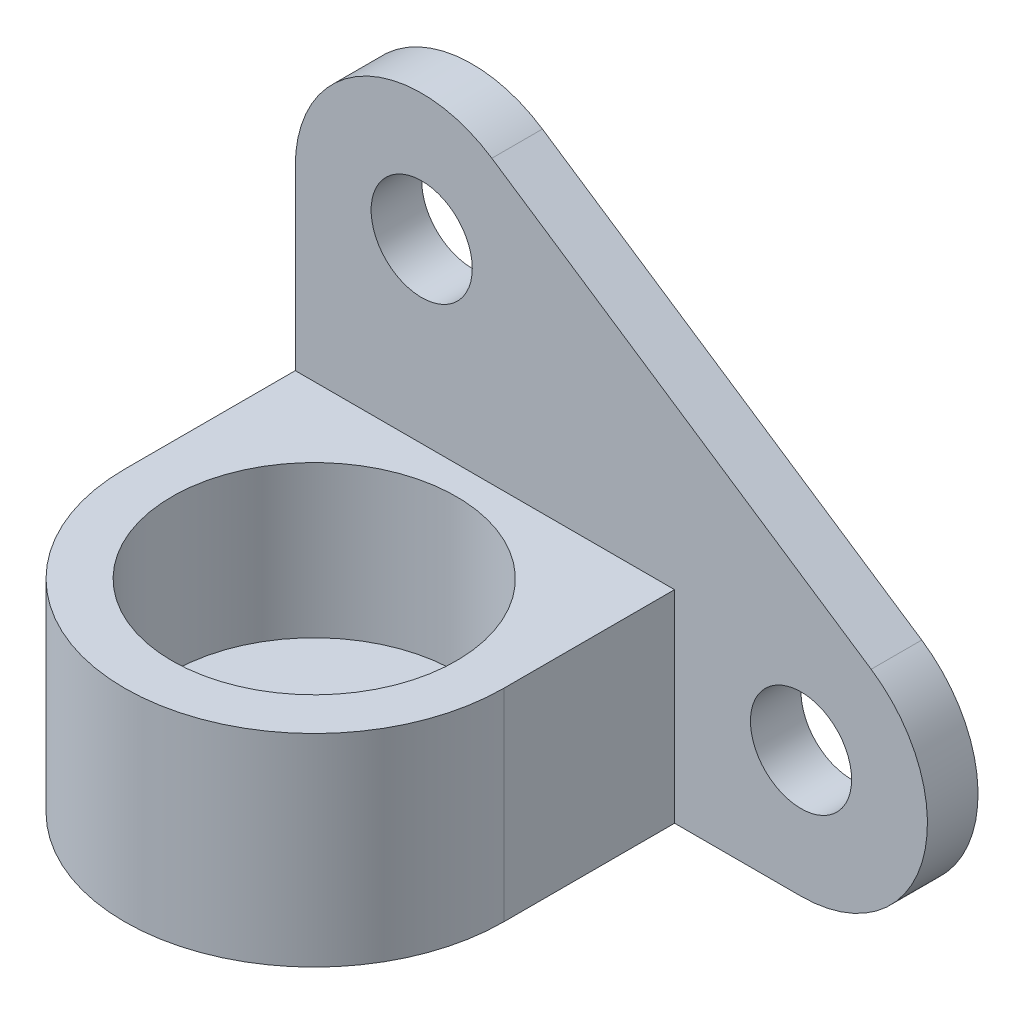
ISO-10303-21;
HEADER;
FILE_DESCRIPTION(('STEP AP214'),'2;1');
FILE_NAME('part.step','',(''),(''),'','','');
FILE_SCHEMA(('AUTOMOTIVE_DESIGN { 1 0 10303 214 1 1 1 1 }'));
ENDSEC;
DATA;
#1=APPLICATION_CONTEXT('core data for automotive mechanical design processes');
#2=APPLICATION_PROTOCOL_DEFINITION('international standard','automotive_design',2000,#1);
#3=PRODUCT_CONTEXT('',#1,'mechanical');
#4=PRODUCT('Part','Part','',(#3));
#5=PRODUCT_RELATED_PRODUCT_CATEGORY('part','',(#4));
#6=PRODUCT_DEFINITION_FORMATION('','',#4);
#7=PRODUCT_DEFINITION_CONTEXT('part definition',#1,'design');
#8=PRODUCT_DEFINITION('design','',#6,#7);
#9=PRODUCT_DEFINITION_SHAPE('','',#8);
#10=(LENGTH_UNIT() NAMED_UNIT(*) SI_UNIT(.MILLI.,.METRE.));
#11=(NAMED_UNIT(*) PLANE_ANGLE_UNIT() SI_UNIT($,.RADIAN.));
#12=(NAMED_UNIT(*) SI_UNIT($,.STERADIAN.) SOLID_ANGLE_UNIT());
#13=UNCERTAINTY_MEASURE_WITH_UNIT(LENGTH_MEASURE(1.E-05),#10,'distance_accuracy_value','');
#14=(GEOMETRIC_REPRESENTATION_CONTEXT(3) GLOBAL_UNCERTAINTY_ASSIGNED_CONTEXT((#13)) GLOBAL_UNIT_ASSIGNED_CONTEXT((#10,
#11,#12)) REPRESENTATION_CONTEXT('',''));
#15=CARTESIAN_POINT('',(0.,0.,0.));
#16=DIRECTION('',(0.,0.,1.));
#17=DIRECTION('',(1.,0.,0.));
#18=AXIS2_PLACEMENT_3D('',#15,#16,#17);
#19=CARTESIAN_POINT('',(20.,60.,8.));
#20=DIRECTION('',(0.,0.,1.));
#21=DIRECTION('',(1.,0.,0.));
#22=AXIS2_PLACEMENT_3D('',#19,#20,#21);
#23=PLANE('',#22);
#24=CARTESIAN_POINT('',(80.,20.,8.));
#25=DIRECTION('',(0.,0.,1.));
#26=DIRECTION('',(1.,0.,0.));
#27=AXIS2_PLACEMENT_3D('',#24,#25,#26);
#28=CIRCLE('',#27,8.);
#29=CARTESIAN_POINT('',(88.,20.,8.));
#30=VERTEX_POINT('',#29);
#31=EDGE_CURVE('E244',#30,#30,#28,.T.);
#32=ORIENTED_EDGE('',*,*,#31,.F.);
#33=EDGE_LOOP('',(#32));
#34=FACE_BOUND('',#33,.T.);
#35=CARTESIAN_POINT('',(20.,60.,8.));
#36=DIRECTION('',(0.,0.,1.));
#37=DIRECTION('',(1.,0.,0.));
#38=AXIS2_PLACEMENT_3D('',#35,#36,#37);
#39=CIRCLE('',#38,8.);
#40=CARTESIAN_POINT('',(28.,60.,8.));
#41=VERTEX_POINT('',#40);
#42=EDGE_CURVE('E246',#41,#41,#39,.T.);
#43=ORIENTED_EDGE('',*,*,#42,.F.);
#44=EDGE_LOOP('',(#43));
#45=FACE_BOUND('',#44,.T.);
#46=DIRECTION('',(0.,-1.,0.));
#47=VECTOR('',#46,1.);
#48=CARTESIAN_POINT('',(0.,0.,8.));
#49=LINE('',#48,#47);
#50=CARTESIAN_POINT('',(0.,60.,8.));
#51=VERTEX_POINT('',#50);
#52=CARTESIAN_POINT('',(0.,32.,8.));
#53=VERTEX_POINT('',#52);
#54=EDGE_CURVE('E142',#51,#53,#49,.T.);
#55=ORIENTED_EDGE('',*,*,#54,.T.);
#56=DIRECTION('',(1.,0.,0.));
#57=VECTOR('',#56,1.);
#58=CARTESIAN_POINT('',(0.,32.,8.));
#59=LINE('',#58,#57);
#60=CARTESIAN_POINT('',(60.,32.,8.));
#61=VERTEX_POINT('',#60);
#62=EDGE_CURVE('E122',#53,#61,#59,.T.);
#63=ORIENTED_EDGE('',*,*,#62,.T.);
#64=DIRECTION('',(0.,-1.,0.));
#65=VECTOR('',#64,1.);
#66=CARTESIAN_POINT('',(60.,32.,8.));
#67=LINE('',#66,#65);
#68=CARTESIAN_POINT('',(60.,0.,8.));
#69=VERTEX_POINT('',#68);
#70=EDGE_CURVE('E106',#61,#69,#67,.T.);
#71=ORIENTED_EDGE('',*,*,#70,.T.);
#72=DIRECTION('',(1.,0.,0.));
#73=VECTOR('',#72,1.);
#74=CARTESIAN_POINT('',(0.,0.,8.));
#75=LINE('',#74,#73);
#76=CARTESIAN_POINT('',(80.,0.,8.));
#77=VERTEX_POINT('',#76);
#78=EDGE_CURVE('E114',#69,#77,#75,.T.);
#79=ORIENTED_EDGE('',*,*,#78,.T.);
#80=CARTESIAN_POINT('',(80.,20.,8.));
#81=DIRECTION('',(0.,0.,1.));
#82=DIRECTION('',(1.,0.,0.));
#83=AXIS2_PLACEMENT_3D('',#80,#81,#82);
#84=CIRCLE('',#83,20.);
#85=CARTESIAN_POINT('',(91.0940039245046,36.6410058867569,8.));
#86=VERTEX_POINT('',#85);
#87=EDGE_CURVE('E160',#77,#86,#84,.T.);
#88=ORIENTED_EDGE('',*,*,#87,.T.);
#89=DIRECTION('',(-0.832050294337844,0.554700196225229,0.));
#90=VECTOR('',#89,1.);
#91=CARTESIAN_POINT('',(31.0940039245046,76.6410058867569,8.));
#92=LINE('',#91,#90);
#93=CARTESIAN_POINT('',(31.0940039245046,76.6410058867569,8.));
#94=VERTEX_POINT('',#93);
#95=EDGE_CURVE('E178',#86,#94,#92,.T.);
#96=ORIENTED_EDGE('',*,*,#95,.T.);
#97=CARTESIAN_POINT('',(20.,60.,8.));
#98=DIRECTION('',(0.,0.,1.));
#99=DIRECTION('',(1.,0.,0.));
#100=AXIS2_PLACEMENT_3D('',#97,#98,#99);
#101=CIRCLE('',#100,20.);
#102=EDGE_CURVE('E56',#94,#51,#101,.T.);
#103=ORIENTED_EDGE('',*,*,#102,.T.);
#104=EDGE_LOOP('',(#55,#63,#71,#79,#88,#96,#103));
#105=FACE_BOUND('',#104,.T.);
#106=ADVANCED_FACE('F31',(#34,#45,#105),#23,.T.);
#107=CARTESIAN_POINT('',(0.,0.,8.));
#108=DIRECTION('',(1.,0.,0.));
#109=DIRECTION('',(0.,0.,-1.));
#110=AXIS2_PLACEMENT_3D('',#107,#108,#109);
#111=PLANE('',#110);
#112=DIRECTION('',(0.,-1.,0.));
#113=VECTOR('',#112,1.);
#114=CARTESIAN_POINT('',(0.,0.,0.));
#115=LINE('',#114,#113);
#116=CARTESIAN_POINT('',(0.,60.,0.));
#117=VERTEX_POINT('',#116);
#118=CARTESIAN_POINT('',(0.,0.,0.));
#119=VERTEX_POINT('',#118);
#120=EDGE_CURVE('E129',#117,#119,#115,.T.);
#121=ORIENTED_EDGE('',*,*,#120,.T.);
#122=DIRECTION('',(0.,0.,-1.));
#123=VECTOR('',#122,1.);
#124=CARTESIAN_POINT('',(0.,0.,8.));
#125=LINE('',#124,#123);
#126=CARTESIAN_POINT('',(0.,0.,35.));
#127=VERTEX_POINT('',#126);
#128=EDGE_CURVE('E11',#127,#119,#125,.T.);
#129=ORIENTED_EDGE('',*,*,#128,.F.);
#130=DIRECTION('',(0.,-1.,0.));
#131=VECTOR('',#130,1.);
#132=CARTESIAN_POINT('',(0.,32.,35.));
#133=LINE('',#132,#131);
#134=CARTESIAN_POINT('',(0.,32.,35.));
#135=VERTEX_POINT('',#134);
#136=EDGE_CURVE('E105',#135,#127,#133,.T.);
#137=ORIENTED_EDGE('',*,*,#136,.F.);
#138=DIRECTION('',(0.,0.,-1.));
#139=VECTOR('',#138,1.);
#140=CARTESIAN_POINT('',(0.,32.,8.));
#141=LINE('',#140,#139);
#142=EDGE_CURVE('E119',#135,#53,#141,.T.);
#143=ORIENTED_EDGE('',*,*,#142,.T.);
#144=ORIENTED_EDGE('',*,*,#54,.F.);
#145=DIRECTION('',(0.,0.,-1.));
#146=VECTOR('',#145,1.);
#147=CARTESIAN_POINT('',(0.,60.,8.));
#148=LINE('',#147,#146);
#149=EDGE_CURVE('E182',#51,#117,#148,.T.);
#150=ORIENTED_EDGE('',*,*,#149,.T.);
#151=EDGE_LOOP('',(#121,#129,#137,#143,#144,#150));
#152=FACE_BOUND('',#151,.T.);
#153=ADVANCED_FACE('F33',(#152),#111,.F.);
#154=CARTESIAN_POINT('',(0.,0.,8.));
#155=DIRECTION('',(0.,1.,0.));
#156=DIRECTION('',(0.,0.,1.));
#157=AXIS2_PLACEMENT_3D('',#154,#155,#156);
#158=PLANE('',#157);
#159=CARTESIAN_POINT('',(30.,0.,35.));
#160=DIRECTION('',(0.,1.,0.));
#161=DIRECTION('',(0.,0.,1.));
#162=AXIS2_PLACEMENT_3D('',#159,#160,#161);
#163=CIRCLE('',#162,9.);
#164=CARTESIAN_POINT('',(30.,0.,44.));
#165=VERTEX_POINT('',#164);
#166=EDGE_CURVE('E257',#165,#165,#163,.T.);
#167=ORIENTED_EDGE('',*,*,#166,.T.);
#168=EDGE_LOOP('',(#167));
#169=FACE_BOUND('',#168,.T.);
#170=DIRECTION('',(1.,0.,0.));
#171=VECTOR('',#170,1.);
#172=CARTESIAN_POINT('',(0.,0.,0.));
#173=LINE('',#172,#171);
#174=CARTESIAN_POINT('',(80.,0.,0.));
#175=VERTEX_POINT('',#174);
#176=EDGE_CURVE('E150',#119,#175,#173,.T.);
#177=ORIENTED_EDGE('',*,*,#176,.T.);
#178=DIRECTION('',(0.,0.,-1.));
#179=VECTOR('',#178,1.);
#180=CARTESIAN_POINT('',(80.,0.,8.));
#181=LINE('',#180,#179);
#182=EDGE_CURVE('E40',#77,#175,#181,.T.);
#183=ORIENTED_EDGE('',*,*,#182,.F.);
#184=ORIENTED_EDGE('',*,*,#78,.F.);
#185=DIRECTION('',(0.,0.,1.));
#186=VECTOR('',#185,1.);
#187=CARTESIAN_POINT('',(60.,0.,8.));
#188=LINE('',#187,#186);
#189=CARTESIAN_POINT('',(60.,0.,35.));
#190=VERTEX_POINT('',#189);
#191=EDGE_CURVE('E48',#69,#190,#188,.T.);
#192=ORIENTED_EDGE('',*,*,#191,.T.);
#193=CARTESIAN_POINT('',(30.,0.,35.));
#194=DIRECTION('',(0.,-1.,0.));
#195=DIRECTION('',(0.,0.,-1.));
#196=AXIS2_PLACEMENT_3D('',#193,#194,#195);
#197=CIRCLE('',#196,30.);
#198=EDGE_CURVE('E112',#190,#127,#197,.T.);
#199=ORIENTED_EDGE('',*,*,#198,.T.);
#200=ORIENTED_EDGE('',*,*,#128,.T.);
#201=EDGE_LOOP('',(#177,#183,#184,#192,#199,#200));
#202=FACE_BOUND('',#201,.T.);
#203=ADVANCED_FACE('F111',(#169,#202),#158,.F.);
#204=CARTESIAN_POINT('',(80.,20.,8.));
#205=DIRECTION('',(0.,0.,-1.));
#206=DIRECTION('',(-1.,0.,0.));
#207=AXIS2_PLACEMENT_3D('',#204,#205,#206);
#208=CYLINDRICAL_SURFACE('',#207,20.);
#209=CARTESIAN_POINT('',(80.,20.,0.));
#210=DIRECTION('',(0.,0.,1.));
#211=DIRECTION('',(1.,0.,0.));
#212=AXIS2_PLACEMENT_3D('',#209,#210,#211);
#213=CIRCLE('',#212,20.);
#214=CARTESIAN_POINT('',(91.0940039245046,36.6410058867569,0.));
#215=VERTEX_POINT('',#214);
#216=EDGE_CURVE('E155',#175,#215,#213,.T.);
#217=ORIENTED_EDGE('',*,*,#216,.T.);
#218=DIRECTION('',(0.,0.,-1.));
#219=VECTOR('',#218,1.);
#220=CARTESIAN_POINT('',(91.0940039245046,36.6410058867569,8.));
#221=LINE('',#220,#219);
#222=EDGE_CURVE('E161',#86,#215,#221,.T.);
#223=ORIENTED_EDGE('',*,*,#222,.F.);
#224=ORIENTED_EDGE('',*,*,#87,.F.);
#225=ORIENTED_EDGE('',*,*,#182,.T.);
#226=EDGE_LOOP('',(#217,#223,#224,#225));
#227=FACE_BOUND('',#226,.T.);
#228=ADVANCED_FACE('F157',(#227),#208,.T.);
#229=CARTESIAN_POINT('',(31.0940039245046,76.6410058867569,8.));
#230=DIRECTION('',(-0.554700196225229,-0.832050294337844,0.));
#231=DIRECTION('',(0.832050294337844,-0.554700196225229,0.));
#232=AXIS2_PLACEMENT_3D('',#229,#230,#231);
#233=PLANE('',#232);
#234=DIRECTION('',(-0.832050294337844,0.554700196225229,0.));
#235=VECTOR('',#234,1.);
#236=CARTESIAN_POINT('',(31.0940039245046,76.6410058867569,0.));
#237=LINE('',#236,#235);
#238=CARTESIAN_POINT('',(31.0940039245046,76.6410058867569,0.));
#239=VERTEX_POINT('',#238);
#240=EDGE_CURVE('E166',#215,#239,#237,.T.);
#241=ORIENTED_EDGE('',*,*,#240,.T.);
#242=DIRECTION('',(0.,0.,-1.));
#243=VECTOR('',#242,1.);
#244=CARTESIAN_POINT('',(31.0940039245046,76.6410058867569,8.));
#245=LINE('',#244,#243);
#246=EDGE_CURVE('E184',#94,#239,#245,.T.);
#247=ORIENTED_EDGE('',*,*,#246,.F.);
#248=ORIENTED_EDGE('',*,*,#95,.F.);
#249=ORIENTED_EDGE('',*,*,#222,.T.);
#250=EDGE_LOOP('',(#241,#247,#248,#249));
#251=FACE_BOUND('',#250,.T.);
#252=ADVANCED_FACE('F189',(#251),#233,.F.);
#253=CARTESIAN_POINT('',(20.,60.,8.));
#254=DIRECTION('',(0.,0.,-1.));
#255=DIRECTION('',(-1.,0.,0.));
#256=AXIS2_PLACEMENT_3D('',#253,#254,#255);
#257=CYLINDRICAL_SURFACE('',#256,20.);
#258=CARTESIAN_POINT('',(20.,60.,0.));
#259=DIRECTION('',(0.,0.,1.));
#260=DIRECTION('',(1.,0.,0.));
#261=AXIS2_PLACEMENT_3D('',#258,#259,#260);
#262=CIRCLE('',#261,20.);
#263=EDGE_CURVE('E168',#239,#117,#262,.T.);
#264=ORIENTED_EDGE('',*,*,#263,.T.);
#265=ORIENTED_EDGE('',*,*,#149,.F.);
#266=ORIENTED_EDGE('',*,*,#102,.F.);
#267=ORIENTED_EDGE('',*,*,#246,.T.);
#268=EDGE_LOOP('',(#264,#265,#266,#267));
#269=FACE_BOUND('',#268,.T.);
#270=ADVANCED_FACE('F192',(#269),#257,.T.);
#271=CARTESIAN_POINT('',(20.,60.,0.));
#272=DIRECTION('',(0.,0.,1.));
#273=DIRECTION('',(1.,0.,0.));
#274=AXIS2_PLACEMENT_3D('',#271,#272,#273);
#275=PLANE('',#274);
#276=CARTESIAN_POINT('',(80.,20.,0.));
#277=DIRECTION('',(0.,0.,1.));
#278=DIRECTION('',(1.,0.,0.));
#279=AXIS2_PLACEMENT_3D('',#276,#277,#278);
#280=CIRCLE('',#279,8.);
#281=CARTESIAN_POINT('',(88.,20.,0.));
#282=VERTEX_POINT('',#281);
#283=EDGE_CURVE('E242',#282,#282,#280,.T.);
#284=ORIENTED_EDGE('',*,*,#283,.T.);
#285=EDGE_LOOP('',(#284));
#286=FACE_BOUND('',#285,.T.);
#287=CARTESIAN_POINT('',(20.,60.,0.));
#288=DIRECTION('',(0.,0.,1.));
#289=DIRECTION('',(1.,0.,0.));
#290=AXIS2_PLACEMENT_3D('',#287,#288,#289);
#291=CIRCLE('',#290,8.);
#292=CARTESIAN_POINT('',(28.,60.,0.));
#293=VERTEX_POINT('',#292);
#294=EDGE_CURVE('E251',#293,#293,#291,.T.);
#295=ORIENTED_EDGE('',*,*,#294,.T.);
#296=EDGE_LOOP('',(#295));
#297=FACE_BOUND('',#296,.T.);
#298=ORIENTED_EDGE('',*,*,#120,.F.);
#299=ORIENTED_EDGE('',*,*,#263,.F.);
#300=ORIENTED_EDGE('',*,*,#240,.F.);
#301=ORIENTED_EDGE('',*,*,#216,.F.);
#302=ORIENTED_EDGE('',*,*,#176,.F.);
#303=EDGE_LOOP('',(#298,#299,#300,#301,#302));
#304=FACE_BOUND('',#303,.T.);
#305=ADVANCED_FACE('F164',(#286,#297,#304),#275,.F.);
#306=CARTESIAN_POINT('',(30.,32.,35.));
#307=DIRECTION('',(0.,-1.,0.));
#308=DIRECTION('',(0.,0.,-1.));
#309=AXIS2_PLACEMENT_3D('',#306,#307,#308);
#310=CYLINDRICAL_SURFACE('',#309,30.);
#311=ORIENTED_EDGE('',*,*,#198,.F.);
#312=DIRECTION('',(0.,-1.,0.));
#313=VECTOR('',#312,1.);
#314=CARTESIAN_POINT('',(60.,32.,35.));
#315=LINE('',#314,#313);
#316=CARTESIAN_POINT('',(60.,32.,35.));
#317=VERTEX_POINT('',#316);
#318=EDGE_CURVE('E97',#317,#190,#315,.T.);
#319=ORIENTED_EDGE('',*,*,#318,.F.);
#320=CARTESIAN_POINT('',(30.,32.,35.));
#321=DIRECTION('',(0.,-1.,0.));
#322=DIRECTION('',(0.,0.,-1.));
#323=AXIS2_PLACEMENT_3D('',#320,#321,#322);
#324=CIRCLE('',#323,30.);
#325=EDGE_CURVE('E127',#317,#135,#324,.T.);
#326=ORIENTED_EDGE('',*,*,#325,.T.);
#327=ORIENTED_EDGE('',*,*,#136,.T.);
#328=EDGE_LOOP('',(#311,#319,#326,#327));
#329=FACE_BOUND('',#328,.T.);
#330=ADVANCED_FACE('F118',(#329),#310,.T.);
#331=CARTESIAN_POINT('',(60.,32.,8.));
#332=DIRECTION('',(1.,0.,0.));
#333=DIRECTION('',(0.,0.,-1.));
#334=AXIS2_PLACEMENT_3D('',#331,#332,#333);
#335=PLANE('',#334);
#336=ORIENTED_EDGE('',*,*,#191,.F.);
#337=ORIENTED_EDGE('',*,*,#70,.F.);
#338=DIRECTION('',(0.,0.,1.));
#339=VECTOR('',#338,1.);
#340=CARTESIAN_POINT('',(60.,32.,8.));
#341=LINE('',#340,#339);
#342=EDGE_CURVE('E100',#61,#317,#341,.T.);
#343=ORIENTED_EDGE('',*,*,#342,.T.);
#344=ORIENTED_EDGE('',*,*,#318,.T.);
#345=EDGE_LOOP('',(#336,#337,#343,#344));
#346=FACE_BOUND('',#345,.T.);
#347=ADVANCED_FACE('F98',(#346),#335,.T.);
#348=CARTESIAN_POINT('',(30.,32.,35.));
#349=DIRECTION('',(0.,-1.,0.));
#350=DIRECTION('',(0.,0.,-1.));
#351=AXIS2_PLACEMENT_3D('',#348,#349,#350);
#352=PLANE('',#351);
#353=CARTESIAN_POINT('',(30.,32.,35.));
#354=DIRECTION('',(0.,1.,0.));
#355=DIRECTION('',(0.,0.,1.));
#356=AXIS2_PLACEMENT_3D('',#353,#354,#355);
#357=CIRCLE('',#356,22.5);
#358=CARTESIAN_POINT('',(30.,32.,57.5));
#359=VERTEX_POINT('',#358);
#360=EDGE_CURVE('E259',#359,#359,#357,.T.);
#361=ORIENTED_EDGE('',*,*,#360,.F.);
#362=EDGE_LOOP('',(#361));
#363=FACE_BOUND('',#362,.T.);
#364=ORIENTED_EDGE('',*,*,#142,.F.);
#365=ORIENTED_EDGE('',*,*,#325,.F.);
#366=ORIENTED_EDGE('',*,*,#342,.F.);
#367=ORIENTED_EDGE('',*,*,#62,.F.);
#368=EDGE_LOOP('',(#364,#365,#366,#367));
#369=FACE_BOUND('',#368,.T.);
#370=ADVANCED_FACE('F145',(#363,#369),#352,.F.);
#371=CARTESIAN_POINT('',(30.,8.,35.));
#372=DIRECTION('',(0.,1.,0.));
#373=DIRECTION('',(0.,0.,1.));
#374=AXIS2_PLACEMENT_3D('',#371,#372,#373);
#375=CYLINDRICAL_SURFACE('',#374,22.5);
#376=CARTESIAN_POINT('',(30.,8.,35.));
#377=DIRECTION('',(0.,1.,0.));
#378=DIRECTION('',(0.,0.,1.));
#379=AXIS2_PLACEMENT_3D('',#376,#377,#378);
#380=CIRCLE('',#379,22.5);
#381=CARTESIAN_POINT('',(30.,8.,57.5));
#382=VERTEX_POINT('',#381);
#383=EDGE_CURVE('E115',#382,#382,#380,.T.);
#384=ORIENTED_EDGE('',*,*,#383,.F.);
#385=EDGE_LOOP('',(#384));
#386=FACE_BOUND('',#385,.T.);
#387=ORIENTED_EDGE('',*,*,#360,.T.);
#388=EDGE_LOOP('',(#387));
#389=FACE_BOUND('',#388,.T.);
#390=ADVANCED_FACE('F217',(#386,#389),#375,.F.);
#391=CARTESIAN_POINT('',(30.,8.,35.));
#392=DIRECTION('',(0.,1.,0.));
#393=DIRECTION('',(0.,0.,1.));
#394=AXIS2_PLACEMENT_3D('',#391,#392,#393);
#395=PLANE('',#394);
#396=CARTESIAN_POINT('',(30.,8.,35.));
#397=DIRECTION('',(0.,1.,0.));
#398=DIRECTION('',(0.,0.,1.));
#399=AXIS2_PLACEMENT_3D('',#396,#397,#398);
#400=CIRCLE('',#399,9.);
#401=CARTESIAN_POINT('',(30.,8.,44.));
#402=VERTEX_POINT('',#401);
#403=EDGE_CURVE('E254',#402,#402,#400,.T.);
#404=ORIENTED_EDGE('',*,*,#403,.F.);
#405=EDGE_LOOP('',(#404));
#406=FACE_BOUND('',#405,.T.);
#407=ORIENTED_EDGE('',*,*,#383,.T.);
#408=EDGE_LOOP('',(#407));
#409=FACE_BOUND('',#408,.T.);
#410=ADVANCED_FACE('F221',(#406,#409),#395,.T.);
#411=CARTESIAN_POINT('',(30.,-4.99999999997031E-05,35.));
#412=DIRECTION('',(0.,1.,0.));
#413=DIRECTION('',(0.,0.,1.));
#414=AXIS2_PLACEMENT_3D('',#411,#412,#413);
#415=CYLINDRICAL_SURFACE('',#414,9.);
#416=ORIENTED_EDGE('',*,*,#403,.T.);
#417=EDGE_LOOP('',(#416));
#418=FACE_BOUND('',#417,.T.);
#419=ORIENTED_EDGE('',*,*,#166,.F.);
#420=EDGE_LOOP('',(#419));
#421=FACE_BOUND('',#420,.T.);
#422=ADVANCED_FACE('F225',(#418,#421),#415,.F.);
#423=CARTESIAN_POINT('',(20.,60.,0.));
#424=DIRECTION('',(0.,0.,1.));
#425=DIRECTION('',(1.,0.,0.));
#426=AXIS2_PLACEMENT_3D('',#423,#424,#425);
#427=CYLINDRICAL_SURFACE('',#426,8.);
#428=ORIENTED_EDGE('',*,*,#294,.F.);
#429=EDGE_LOOP('',(#428));
#430=FACE_BOUND('',#429,.T.);
#431=ORIENTED_EDGE('',*,*,#42,.T.);
#432=EDGE_LOOP('',(#431));
#433=FACE_BOUND('',#432,.T.);
#434=ADVANCED_FACE('F229',(#430,#433),#427,.F.);
#435=CARTESIAN_POINT('',(80.,20.,0.));
#436=DIRECTION('',(0.,0.,1.));
#437=DIRECTION('',(1.,0.,0.));
#438=AXIS2_PLACEMENT_3D('',#435,#436,#437);
#439=CYLINDRICAL_SURFACE('',#438,8.);
#440=ORIENTED_EDGE('',*,*,#283,.F.);
#441=EDGE_LOOP('',(#440));
#442=FACE_BOUND('',#441,.T.);
#443=ORIENTED_EDGE('',*,*,#31,.T.);
#444=EDGE_LOOP('',(#443));
#445=FACE_BOUND('',#444,.T.);
#446=ADVANCED_FACE('F233',(#442,#445),#439,.F.);
#447=CLOSED_SHELL('',(#106,#153,#203,#228,#252,#270,#305,#330,#347,#370,#390,#410,#422,#434,#446));
#448=MANIFOLD_SOLID_BREP('B2',#447);
#449=ADVANCED_BREP_SHAPE_REPRESENTATION('',(#18,#448),#14);
#450=SHAPE_DEFINITION_REPRESENTATION(#9,#449);
ENDSEC;
END-ISO-10303-21;
